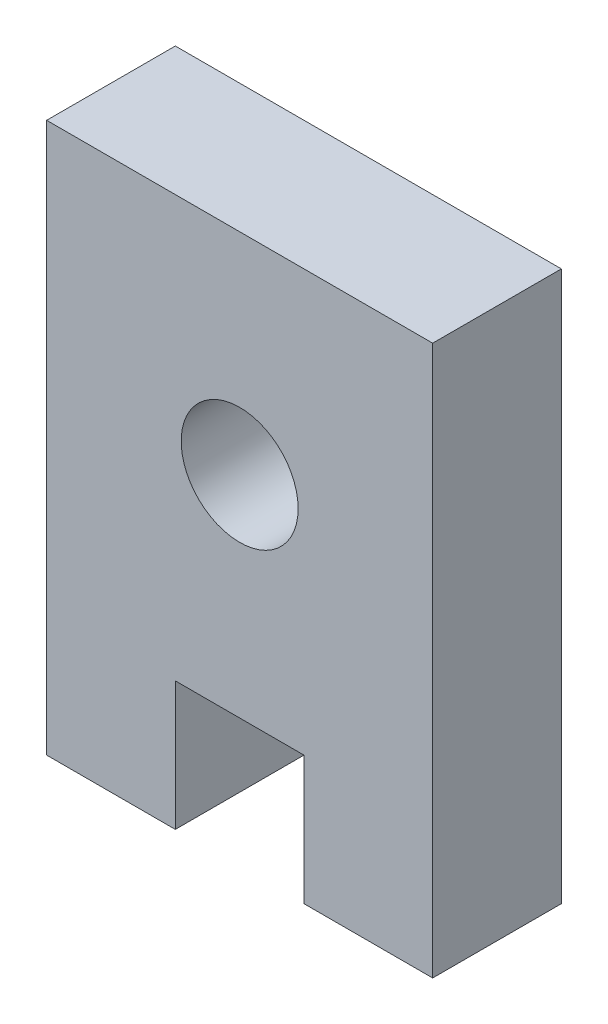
ISO-10303-21;
HEADER;
FILE_DESCRIPTION(('STEP AP214'),'2;1');
FILE_NAME('part.step','',(''),(''),'','','');
FILE_SCHEMA(('AUTOMOTIVE_DESIGN { 1 0 10303 214 1 1 1 1 }'));
ENDSEC;
DATA;
#1=APPLICATION_CONTEXT('core data for automotive mechanical design processes');
#2=APPLICATION_PROTOCOL_DEFINITION('international standard','automotive_design',2000,#1);
#3=PRODUCT_CONTEXT('',#1,'mechanical');
#4=PRODUCT('Part','Part','',(#3));
#5=PRODUCT_RELATED_PRODUCT_CATEGORY('part','',(#4));
#6=PRODUCT_DEFINITION_FORMATION('','',#4);
#7=PRODUCT_DEFINITION_CONTEXT('part definition',#1,'design');
#8=PRODUCT_DEFINITION('design','',#6,#7);
#9=PRODUCT_DEFINITION_SHAPE('','',#8);
#10=(LENGTH_UNIT() NAMED_UNIT(*) SI_UNIT(.MILLI.,.METRE.));
#11=(NAMED_UNIT(*) PLANE_ANGLE_UNIT() SI_UNIT($,.RADIAN.));
#12=(NAMED_UNIT(*) SI_UNIT($,.STERADIAN.) SOLID_ANGLE_UNIT());
#13=UNCERTAINTY_MEASURE_WITH_UNIT(LENGTH_MEASURE(1.E-05),#10,'distance_accuracy_value','');
#14=(GEOMETRIC_REPRESENTATION_CONTEXT(3) GLOBAL_UNCERTAINTY_ASSIGNED_CONTEXT((#13)) GLOBAL_UNIT_ASSIGNED_CONTEXT((#10,
#11,#12)) REPRESENTATION_CONTEXT('',''));
#15=CARTESIAN_POINT('',(0.,0.,0.));
#16=DIRECTION('',(0.,0.,1.));
#17=DIRECTION('',(1.,0.,0.));
#18=AXIS2_PLACEMENT_3D('',#15,#16,#17);
#19=CARTESIAN_POINT('',(0.,0.,5.5));
#20=DIRECTION('',(0.,0.,-1.));
#21=DIRECTION('',(-1.,0.,0.));
#22=AXIS2_PLACEMENT_3D('',#19,#20,#21);
#23=PLANE('',#22);
#24=DIRECTION('',(1.,0.,0.));
#25=VECTOR('',#24,1.);
#26=CARTESIAN_POINT('',(0.,0.,5.5));
#27=LINE('',#26,#25);
#28=CARTESIAN_POINT('',(-5.5,0.,5.5));
#29=VERTEX_POINT('',#28);
#30=CARTESIAN_POINT('',(0.,0.,5.5));
#31=VERTEX_POINT('',#30);
#32=EDGE_CURVE('E164',#29,#31,#27,.T.);
#33=ORIENTED_EDGE('',*,*,#32,.T.);
#34=DIRECTION('',(0.,1.,0.));
#35=VECTOR('',#34,1.);
#36=CARTESIAN_POINT('',(0.,23.5,5.5));
#37=LINE('',#36,#35);
#38=CARTESIAN_POINT('',(0.,23.5,5.5));
#39=VERTEX_POINT('',#38);
#40=EDGE_CURVE('E100',#31,#39,#37,.T.);
#41=ORIENTED_EDGE('',*,*,#40,.T.);
#42=DIRECTION('',(-1.,0.,0.));
#43=VECTOR('',#42,1.);
#44=CARTESIAN_POINT('',(-16.5,23.5,5.5));
#45=LINE('',#44,#43);
#46=CARTESIAN_POINT('',(-16.5,23.5,5.5));
#47=VERTEX_POINT('',#46);
#48=EDGE_CURVE('E185',#39,#47,#45,.T.);
#49=ORIENTED_EDGE('',*,*,#48,.T.);
#50=DIRECTION('',(0.,-1.,0.));
#51=VECTOR('',#50,1.);
#52=CARTESIAN_POINT('',(-16.5,0.,5.5));
#53=LINE('',#52,#51);
#54=CARTESIAN_POINT('',(-16.5,0.,5.5));
#55=VERTEX_POINT('',#54);
#56=EDGE_CURVE('E199',#47,#55,#53,.T.);
#57=ORIENTED_EDGE('',*,*,#56,.T.);
#58=DIRECTION('',(1.,0.,0.));
#59=VECTOR('',#58,1.);
#60=CARTESIAN_POINT('',(-11.,0.,5.5));
#61=LINE('',#60,#59);
#62=CARTESIAN_POINT('',(-11.,0.,5.5));
#63=VERTEX_POINT('',#62);
#64=EDGE_CURVE('E119',#55,#63,#61,.T.);
#65=ORIENTED_EDGE('',*,*,#64,.T.);
#66=DIRECTION('',(0.,1.,0.));
#67=VECTOR('',#66,1.);
#68=CARTESIAN_POINT('',(-11.,5.5,5.5));
#69=LINE('',#68,#67);
#70=CARTESIAN_POINT('',(-11.,5.5,5.5));
#71=VERTEX_POINT('',#70);
#72=EDGE_CURVE('E113',#63,#71,#69,.T.);
#73=ORIENTED_EDGE('',*,*,#72,.T.);
#74=DIRECTION('',(1.,0.,0.));
#75=VECTOR('',#74,1.);
#76=CARTESIAN_POINT('',(-5.5,5.5,5.5));
#77=LINE('',#76,#75);
#78=CARTESIAN_POINT('',(-5.5,5.5,5.5));
#79=VERTEX_POINT('',#78);
#80=EDGE_CURVE('E117',#71,#79,#77,.T.);
#81=ORIENTED_EDGE('',*,*,#80,.T.);
#82=DIRECTION('',(0.,-1.,0.));
#83=VECTOR('',#82,1.);
#84=CARTESIAN_POINT('',(-5.5,0.,5.5));
#85=LINE('',#84,#83);
#86=EDGE_CURVE('E57',#79,#29,#85,.T.);
#87=ORIENTED_EDGE('',*,*,#86,.T.);
#88=EDGE_LOOP('',(#33,#41,#49,#57,#65,#73,#81,#87));
#89=FACE_BOUND('',#88,.T.);
#90=CARTESIAN_POINT('',(-8.25,14.5,5.5));
#91=DIRECTION('',(0.,0.,1.));
#92=DIRECTION('',(1.,0.,0.));
#93=AXIS2_PLACEMENT_3D('',#90,#91,#92);
#94=CIRCLE('',#93,2.5);
#95=CARTESIAN_POINT('',(-5.75,14.5,5.5));
#96=VERTEX_POINT('',#95);
#97=EDGE_CURVE('E146',#96,#96,#94,.T.);
#98=ORIENTED_EDGE('',*,*,#97,.F.);
#99=EDGE_LOOP('',(#98));
#100=FACE_BOUND('',#99,.T.);
#101=ADVANCED_FACE('F39',(#89,#100),#23,.F.);
#102=CARTESIAN_POINT('',(0.,0.,0.));
#103=DIRECTION('',(0.,0.,-1.));
#104=DIRECTION('',(-1.,0.,0.));
#105=AXIS2_PLACEMENT_3D('',#102,#103,#104);
#106=PLANE('',#105);
#107=DIRECTION('',(1.,0.,0.));
#108=VECTOR('',#107,1.);
#109=CARTESIAN_POINT('',(0.,0.,0.));
#110=LINE('',#109,#108);
#111=CARTESIAN_POINT('',(-5.5,0.,0.));
#112=VERTEX_POINT('',#111);
#113=CARTESIAN_POINT('',(0.,0.,0.));
#114=VERTEX_POINT('',#113);
#115=EDGE_CURVE('E141',#112,#114,#110,.T.);
#116=ORIENTED_EDGE('',*,*,#115,.F.);
#117=DIRECTION('',(0.,-1.,0.));
#118=VECTOR('',#117,1.);
#119=CARTESIAN_POINT('',(-5.5,0.,0.));
#120=LINE('',#119,#118);
#121=CARTESIAN_POINT('',(-5.5,5.5,0.));
#122=VERTEX_POINT('',#121);
#123=EDGE_CURVE('E92',#122,#112,#120,.T.);
#124=ORIENTED_EDGE('',*,*,#123,.F.);
#125=DIRECTION('',(1.,0.,0.));
#126=VECTOR('',#125,1.);
#127=CARTESIAN_POINT('',(-5.5,5.5,0.));
#128=LINE('',#127,#126);
#129=CARTESIAN_POINT('',(-11.,5.5,0.));
#130=VERTEX_POINT('',#129);
#131=EDGE_CURVE('E86',#130,#122,#128,.T.);
#132=ORIENTED_EDGE('',*,*,#131,.F.);
#133=DIRECTION('',(0.,1.,0.));
#134=VECTOR('',#133,1.);
#135=CARTESIAN_POINT('',(-11.,5.5,0.));
#136=LINE('',#135,#134);
#137=CARTESIAN_POINT('',(-11.,0.,0.));
#138=VERTEX_POINT('',#137);
#139=EDGE_CURVE('E128',#138,#130,#136,.T.);
#140=ORIENTED_EDGE('',*,*,#139,.F.);
#141=DIRECTION('',(1.,0.,0.));
#142=VECTOR('',#141,1.);
#143=CARTESIAN_POINT('',(-11.,0.,0.));
#144=LINE('',#143,#142);
#145=CARTESIAN_POINT('',(-16.5,0.,0.));
#146=VERTEX_POINT('',#145);
#147=EDGE_CURVE('E155',#146,#138,#144,.T.);
#148=ORIENTED_EDGE('',*,*,#147,.F.);
#149=DIRECTION('',(0.,-1.,0.));
#150=VECTOR('',#149,1.);
#151=CARTESIAN_POINT('',(-16.5,0.,0.));
#152=LINE('',#151,#150);
#153=CARTESIAN_POINT('',(-16.5,23.5,0.));
#154=VERTEX_POINT('',#153);
#155=EDGE_CURVE('E152',#154,#146,#152,.T.);
#156=ORIENTED_EDGE('',*,*,#155,.F.);
#157=DIRECTION('',(-1.,0.,0.));
#158=VECTOR('',#157,1.);
#159=CARTESIAN_POINT('',(-16.5,23.5,0.));
#160=LINE('',#159,#158);
#161=CARTESIAN_POINT('',(0.,23.5,0.));
#162=VERTEX_POINT('',#161);
#163=EDGE_CURVE('E149',#162,#154,#160,.T.);
#164=ORIENTED_EDGE('',*,*,#163,.F.);
#165=DIRECTION('',(0.,1.,0.));
#166=VECTOR('',#165,1.);
#167=CARTESIAN_POINT('',(0.,23.5,0.));
#168=LINE('',#167,#166);
#169=EDGE_CURVE('E145',#114,#162,#168,.T.);
#170=ORIENTED_EDGE('',*,*,#169,.F.);
#171=EDGE_LOOP('',(#116,#124,#132,#140,#148,#156,#164,#170));
#172=FACE_BOUND('',#171,.T.);
#173=CARTESIAN_POINT('',(-8.25,14.5,0.));
#174=DIRECTION('',(0.,0.,1.));
#175=DIRECTION('',(1.,0.,0.));
#176=AXIS2_PLACEMENT_3D('',#173,#174,#175);
#177=CIRCLE('',#176,2.5);
#178=CARTESIAN_POINT('',(-5.75,14.5,0.));
#179=VERTEX_POINT('',#178);
#180=EDGE_CURVE('E209',#179,#179,#177,.T.);
#181=ORIENTED_EDGE('',*,*,#180,.T.);
#182=EDGE_LOOP('',(#181));
#183=FACE_BOUND('',#182,.T.);
#184=ADVANCED_FACE('F189',(#172,#183),#106,.T.);
#185=CARTESIAN_POINT('',(0.,0.,5.5));
#186=DIRECTION('',(0.,1.,0.));
#187=DIRECTION('',(0.,0.,1.));
#188=AXIS2_PLACEMENT_3D('',#185,#186,#187);
#189=PLANE('',#188);
#190=ORIENTED_EDGE('',*,*,#115,.T.);
#191=DIRECTION('',(0.,0.,-1.));
#192=VECTOR('',#191,1.);
#193=CARTESIAN_POINT('',(0.,0.,5.5));
#194=LINE('',#193,#192);
#195=EDGE_CURVE('E11',#31,#114,#194,.T.);
#196=ORIENTED_EDGE('',*,*,#195,.F.);
#197=ORIENTED_EDGE('',*,*,#32,.F.);
#198=DIRECTION('',(0.,0.,-1.));
#199=VECTOR('',#198,1.);
#200=CARTESIAN_POINT('',(-5.5,0.,5.5));
#201=LINE('',#200,#199);
#202=EDGE_CURVE('E137',#29,#112,#201,.T.);
#203=ORIENTED_EDGE('',*,*,#202,.T.);
#204=EDGE_LOOP('',(#190,#196,#197,#203));
#205=FACE_BOUND('',#204,.T.);
#206=ADVANCED_FACE('F41',(#205),#189,.F.);
#207=CARTESIAN_POINT('',(0.,23.5,5.5));
#208=DIRECTION('',(-1.,0.,0.));
#209=DIRECTION('',(0.,0.,1.));
#210=AXIS2_PLACEMENT_3D('',#207,#208,#209);
#211=PLANE('',#210);
#212=ORIENTED_EDGE('',*,*,#169,.T.);
#213=DIRECTION('',(0.,0.,-1.));
#214=VECTOR('',#213,1.);
#215=CARTESIAN_POINT('',(0.,23.5,5.5));
#216=LINE('',#215,#214);
#217=EDGE_CURVE('E49',#39,#162,#216,.T.);
#218=ORIENTED_EDGE('',*,*,#217,.F.);
#219=ORIENTED_EDGE('',*,*,#40,.F.);
#220=ORIENTED_EDGE('',*,*,#195,.T.);
#221=EDGE_LOOP('',(#212,#218,#219,#220));
#222=FACE_BOUND('',#221,.T.);
#223=ADVANCED_FACE('F239',(#222),#211,.F.);
#224=CARTESIAN_POINT('',(-16.5,23.5,5.5));
#225=DIRECTION('',(0.,-1.,0.));
#226=DIRECTION('',(0.,0.,-1.));
#227=AXIS2_PLACEMENT_3D('',#224,#225,#226);
#228=PLANE('',#227);
#229=ORIENTED_EDGE('',*,*,#163,.T.);
#230=DIRECTION('',(0.,0.,-1.));
#231=VECTOR('',#230,1.);
#232=CARTESIAN_POINT('',(-16.5,23.5,5.5));
#233=LINE('',#232,#231);
#234=EDGE_CURVE('E175',#47,#154,#233,.T.);
#235=ORIENTED_EDGE('',*,*,#234,.F.);
#236=ORIENTED_EDGE('',*,*,#48,.F.);
#237=ORIENTED_EDGE('',*,*,#217,.T.);
#238=EDGE_LOOP('',(#229,#235,#236,#237));
#239=FACE_BOUND('',#238,.T.);
#240=ADVANCED_FACE('F183',(#239),#228,.F.);
#241=CARTESIAN_POINT('',(-16.5,0.,5.5));
#242=DIRECTION('',(1.,0.,0.));
#243=DIRECTION('',(0.,0.,-1.));
#244=AXIS2_PLACEMENT_3D('',#241,#242,#243);
#245=PLANE('',#244);
#246=ORIENTED_EDGE('',*,*,#155,.T.);
#247=DIRECTION('',(0.,0.,-1.));
#248=VECTOR('',#247,1.);
#249=CARTESIAN_POINT('',(-16.5,0.,5.5));
#250=LINE('',#249,#248);
#251=EDGE_CURVE('E171',#55,#146,#250,.T.);
#252=ORIENTED_EDGE('',*,*,#251,.F.);
#253=ORIENTED_EDGE('',*,*,#56,.F.);
#254=ORIENTED_EDGE('',*,*,#234,.T.);
#255=EDGE_LOOP('',(#246,#252,#253,#254));
#256=FACE_BOUND('',#255,.T.);
#257=ADVANCED_FACE('F194',(#256),#245,.F.);
#258=CARTESIAN_POINT('',(-11.,0.,5.5));
#259=DIRECTION('',(0.,1.,0.));
#260=DIRECTION('',(0.,0.,1.));
#261=AXIS2_PLACEMENT_3D('',#258,#259,#260);
#262=PLANE('',#261);
#263=ORIENTED_EDGE('',*,*,#147,.T.);
#264=DIRECTION('',(0.,0.,-1.));
#265=VECTOR('',#264,1.);
#266=CARTESIAN_POINT('',(-11.,0.,5.5));
#267=LINE('',#266,#265);
#268=EDGE_CURVE('E130',#63,#138,#267,.T.);
#269=ORIENTED_EDGE('',*,*,#268,.F.);
#270=ORIENTED_EDGE('',*,*,#64,.F.);
#271=ORIENTED_EDGE('',*,*,#251,.T.);
#272=EDGE_LOOP('',(#263,#269,#270,#271));
#273=FACE_BOUND('',#272,.T.);
#274=ADVANCED_FACE('F197',(#273),#262,.F.);
#275=CARTESIAN_POINT('',(-11.,5.5,5.5));
#276=DIRECTION('',(-1.,0.,0.));
#277=DIRECTION('',(0.,0.,1.));
#278=AXIS2_PLACEMENT_3D('',#275,#276,#277);
#279=PLANE('',#278);
#280=ORIENTED_EDGE('',*,*,#139,.T.);
#281=DIRECTION('',(0.,0.,-1.));
#282=VECTOR('',#281,1.);
#283=CARTESIAN_POINT('',(-11.,5.5,5.5));
#284=LINE('',#283,#282);
#285=EDGE_CURVE('E125',#71,#130,#284,.T.);
#286=ORIENTED_EDGE('',*,*,#285,.F.);
#287=ORIENTED_EDGE('',*,*,#72,.F.);
#288=ORIENTED_EDGE('',*,*,#268,.T.);
#289=EDGE_LOOP('',(#280,#286,#287,#288));
#290=FACE_BOUND('',#289,.T.);
#291=ADVANCED_FACE('F126',(#290),#279,.F.);
#292=CARTESIAN_POINT('',(-5.5,5.5,5.5));
#293=DIRECTION('',(0.,1.,0.));
#294=DIRECTION('',(0.,0.,1.));
#295=AXIS2_PLACEMENT_3D('',#292,#293,#294);
#296=PLANE('',#295);
#297=ORIENTED_EDGE('',*,*,#131,.T.);
#298=DIRECTION('',(0.,0.,-1.));
#299=VECTOR('',#298,1.);
#300=CARTESIAN_POINT('',(-5.5,5.5,5.5));
#301=LINE('',#300,#299);
#302=EDGE_CURVE('E131',#79,#122,#301,.T.);
#303=ORIENTED_EDGE('',*,*,#302,.F.);
#304=ORIENTED_EDGE('',*,*,#80,.F.);
#305=ORIENTED_EDGE('',*,*,#285,.T.);
#306=EDGE_LOOP('',(#297,#303,#304,#305));
#307=FACE_BOUND('',#306,.T.);
#308=ADVANCED_FACE('F133',(#307),#296,.F.);
#309=CARTESIAN_POINT('',(-5.5,0.,5.5));
#310=DIRECTION('',(1.,0.,0.));
#311=DIRECTION('',(0.,1.,0.));
#312=AXIS2_PLACEMENT_3D('',#309,#310,#311);
#313=PLANE('',#312);
#314=ORIENTED_EDGE('',*,*,#123,.T.);
#315=ORIENTED_EDGE('',*,*,#202,.F.);
#316=ORIENTED_EDGE('',*,*,#86,.F.);
#317=ORIENTED_EDGE('',*,*,#302,.T.);
#318=EDGE_LOOP('',(#314,#315,#316,#317));
#319=FACE_BOUND('',#318,.T.);
#320=ADVANCED_FACE('F227',(#319),#313,.F.);
#321=CARTESIAN_POINT('',(-8.25,14.5,5.5));
#322=DIRECTION('',(0.,0.,-1.));
#323=DIRECTION('',(-1.,0.,0.));
#324=AXIS2_PLACEMENT_3D('',#321,#322,#323);
#325=CYLINDRICAL_SURFACE('',#324,2.5);
#326=ORIENTED_EDGE('',*,*,#97,.T.);
#327=EDGE_LOOP('',(#326));
#328=FACE_BOUND('',#327,.T.);
#329=ORIENTED_EDGE('',*,*,#180,.F.);
#330=EDGE_LOOP('',(#329));
#331=FACE_BOUND('',#330,.T.);
#332=ADVANCED_FACE('F217',(#328,#331),#325,.F.);
#333=CLOSED_SHELL('',(#101,#184,#206,#223,#240,#257,#274,#291,#308,#320,#332));
#334=MANIFOLD_SOLID_BREP('B2',#333);
#335=ADVANCED_BREP_SHAPE_REPRESENTATION('',(#18,#334),#14);
#336=SHAPE_DEFINITION_REPRESENTATION(#9,#335);
ENDSEC;
END-ISO-10303-21;
